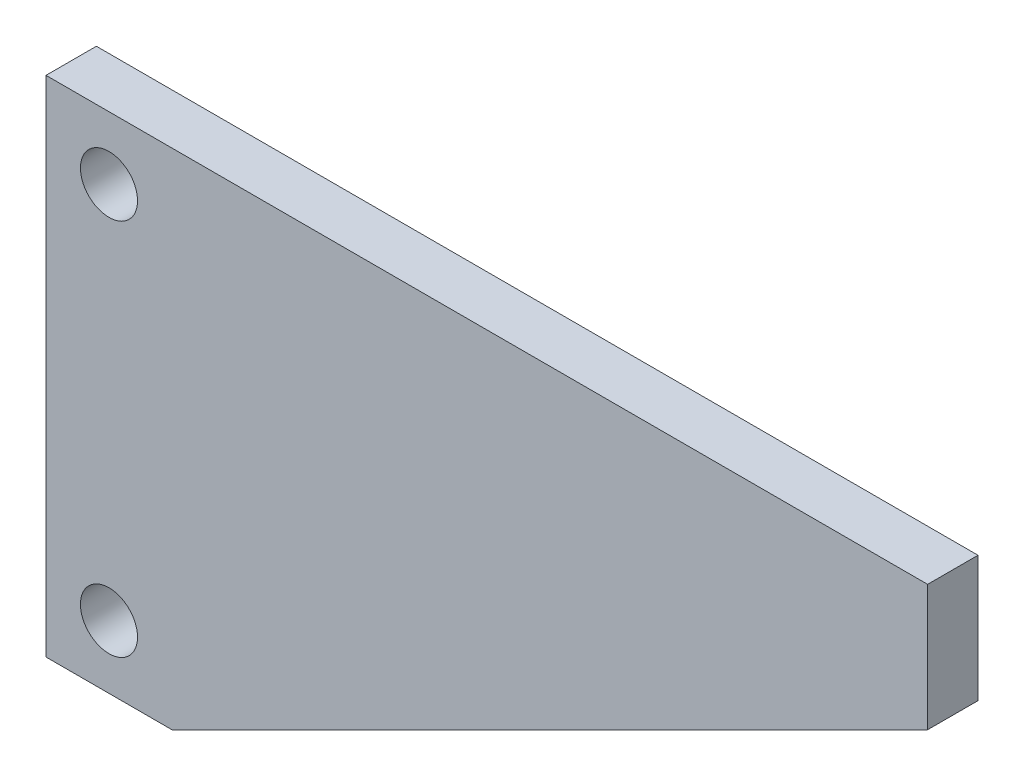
from build123d import *

# Parameters (mm, degrees)
BOSS_EXTRUDE1_DEPTH = 5
SKETCH3_R           = 5.667551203
CUT_EXTRUDE2_DEPTH  = 202.804360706


with BuildPart() as part:
    # Sketch1 → Boss-Extrude1 (new, symmetric)
    with BuildSketch(Plane.XY):
        Polygon((0, 100), (175, 100), (175, 75), (25, 0), (0, 0), align=None)
    extrude(amount=BOSS_EXTRUDE1_DEPTH, both=True)

    # Sketch3 → Cut-Extrude2 (cut, through all)
    with BuildSketch(Plane.XY.offset(5)):
        with Locations((12.5, 87.5)):
            Circle(SKETCH3_R)
        with Locations((12.5, 12.5)):
            Circle(SKETCH3_R)
    extrude(amount=-CUT_EXTRUDE2_DEPTH, mode=Mode.SUBTRACT)


solid = part.part
